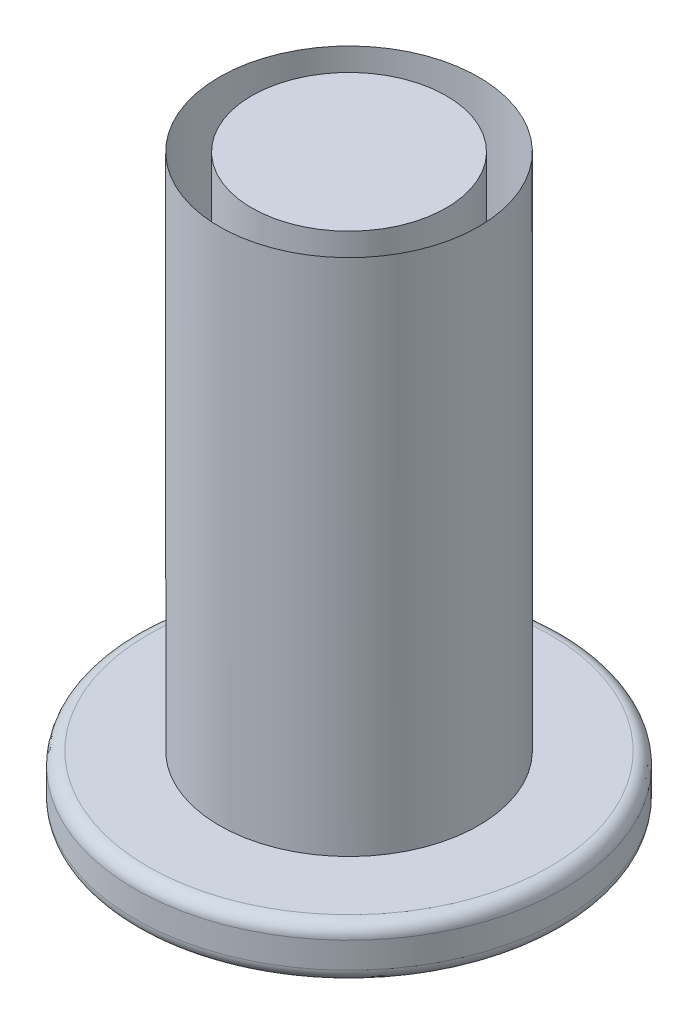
ISO-10303-21;
HEADER;
FILE_DESCRIPTION(('STEP AP214'),'2;1');
FILE_NAME('part.step','',(''),(''),'','','');
FILE_SCHEMA(('AUTOMOTIVE_DESIGN { 1 0 10303 214 1 1 1 1 }'));
ENDSEC;
DATA;
#1=APPLICATION_CONTEXT('core data for automotive mechanical design processes');
#2=APPLICATION_PROTOCOL_DEFINITION('international standard','automotive_design',2000,#1);
#3=PRODUCT_CONTEXT('',#1,'mechanical');
#4=PRODUCT('Part','Part','',(#3));
#5=PRODUCT_RELATED_PRODUCT_CATEGORY('part','',(#4));
#6=PRODUCT_DEFINITION_FORMATION('','',#4);
#7=PRODUCT_DEFINITION_CONTEXT('part definition',#1,'design');
#8=PRODUCT_DEFINITION('design','',#6,#7);
#9=PRODUCT_DEFINITION_SHAPE('','',#8);
#10=(LENGTH_UNIT() NAMED_UNIT(*) SI_UNIT(.MILLI.,.METRE.));
#11=(NAMED_UNIT(*) PLANE_ANGLE_UNIT() SI_UNIT($,.RADIAN.));
#12=(NAMED_UNIT(*) SI_UNIT($,.STERADIAN.) SOLID_ANGLE_UNIT());
#13=UNCERTAINTY_MEASURE_WITH_UNIT(LENGTH_MEASURE(1.E-05),#10,'distance_accuracy_value','');
#14=(GEOMETRIC_REPRESENTATION_CONTEXT(3) GLOBAL_UNCERTAINTY_ASSIGNED_CONTEXT((#13)) GLOBAL_UNIT_ASSIGNED_CONTEXT((#10,
#11,#12)) REPRESENTATION_CONTEXT('',''));
#15=CARTESIAN_POINT('',(0.,0.,0.));
#16=DIRECTION('',(0.,0.,1.));
#17=DIRECTION('',(1.,0.,0.));
#18=AXIS2_PLACEMENT_3D('',#15,#16,#17);
#19=CARTESIAN_POINT('',(0.,0.4,0.));
#20=DIRECTION('',(0.,1.,0.));
#21=DIRECTION('',(-1.,0.,0.));
#22=AXIS2_PLACEMENT_3D('',#19,#20,#21);
#23=CYLINDRICAL_SURFACE('',#22,1.);
#24=CARTESIAN_POINT('',(0.,4.4,0.));
#25=DIRECTION('',(0.,-1.,0.));
#26=DIRECTION('',(1.,0.,0.));
#27=AXIS2_PLACEMENT_3D('',#24,#25,#26);
#28=CIRCLE('',#27,1.);
#29=CARTESIAN_POINT('',(1.,4.4,0.));
#30=VERTEX_POINT('',#29);
#31=EDGE_CURVE('E43',#30,#30,#28,.F.);
#32=ORIENTED_EDGE('',*,*,#31,.F.);
#33=EDGE_LOOP('',(#32));
#34=FACE_BOUND('',#33,.T.);
#35=CARTESIAN_POINT('',(0.,0.4,0.));
#36=DIRECTION('',(0.,1.,0.));
#37=DIRECTION('',(-1.,0.,0.));
#38=AXIS2_PLACEMENT_3D('',#35,#36,#37);
#39=CIRCLE('',#38,1.);
#40=CARTESIAN_POINT('',(-1.,0.4,0.));
#41=VERTEX_POINT('',#40);
#42=EDGE_CURVE('E11',#41,#41,#39,.T.);
#43=ORIENTED_EDGE('',*,*,#42,.T.);
#44=EDGE_LOOP('',(#43));
#45=FACE_BOUND('',#44,.T.);
#46=ADVANCED_FACE('F42',(#34,#45),#23,.T.);
#47=OPEN_SHELL('',(#46));
#48=SHELL_BASED_SURFACE_MODEL('B2',(#47));
#49=CARTESIAN_POINT('',(0.,0.,0.));
#50=DIRECTION('',(0.,1.,0.));
#51=DIRECTION('',(-1.,0.,0.));
#52=AXIS2_PLACEMENT_3D('',#49,#50,#51);
#53=PLANE('',#52);
#54=CARTESIAN_POINT('',(0.,0.,0.));
#55=DIRECTION('',(0.,1.,0.));
#56=DIRECTION('',(-1.,0.,0.));
#57=AXIS2_PLACEMENT_3D('',#54,#55,#56);
#58=CIRCLE('',#57,1.55);
#59=CARTESIAN_POINT('',(-1.55,0.,0.));
#60=VERTEX_POINT('',#59);
#61=EDGE_CURVE('E41',#60,#60,#58,.F.);
#62=ORIENTED_EDGE('',*,*,#61,.T.);
#63=EDGE_LOOP('',(#62));
#64=FACE_BOUND('',#63,.T.);
#65=ADVANCED_FACE('F66',(#64),#53,.F.);
#66=CARTESIAN_POINT('',(0.,4.4,0.));
#67=DIRECTION('',(0.,1.,0.));
#68=DIRECTION('',(-1.,0.,0.));
#69=AXIS2_PLACEMENT_3D('',#66,#67,#68);
#70=CYLINDRICAL_SURFACE('',#69,1.65);
#71=CARTESIAN_POINT('',(0.,0.3,0.));
#72=DIRECTION('',(0.,-1.,0.));
#73=DIRECTION('',(1.,0.,0.));
#74=AXIS2_PLACEMENT_3D('',#71,#72,#73);
#75=CIRCLE('',#74,1.65);
#76=CARTESIAN_POINT('',(1.65,0.3,0.));
#77=VERTEX_POINT('',#76);
#78=EDGE_CURVE('E73',#77,#77,#75,.T.);
#79=ORIENTED_EDGE('',*,*,#78,.T.);
#80=EDGE_LOOP('',(#79));
#81=FACE_BOUND('',#80,.T.);
#82=CARTESIAN_POINT('',(0.,0.1,0.));
#83=DIRECTION('',(0.,1.,0.));
#84=DIRECTION('',(-1.,0.,0.));
#85=AXIS2_PLACEMENT_3D('',#82,#83,#84);
#86=CIRCLE('',#85,1.65);
#87=CARTESIAN_POINT('',(-1.65,0.1,0.));
#88=VERTEX_POINT('',#87);
#89=EDGE_CURVE('E77',#88,#88,#86,.T.);
#90=ORIENTED_EDGE('',*,*,#89,.T.);
#91=EDGE_LOOP('',(#90));
#92=FACE_BOUND('',#91,.T.);
#93=ADVANCED_FACE('F103',(#81,#92),#70,.T.);
#94=CARTESIAN_POINT('',(1.65,0.4,0.));
#95=DIRECTION('',(0.,-1.,0.));
#96=DIRECTION('',(1.,0.,0.));
#97=AXIS2_PLACEMENT_3D('',#94,#95,#96);
#98=PLANE('',#97);
#99=CARTESIAN_POINT('',(0.,0.4,0.));
#100=DIRECTION('',(0.,-1.,0.));
#101=DIRECTION('',(1.,0.,0.));
#102=AXIS2_PLACEMENT_3D('',#99,#100,#101);
#103=CIRCLE('',#102,1.55);
#104=CARTESIAN_POINT('',(1.55,0.4,0.));
#105=VERTEX_POINT('',#104);
#106=EDGE_CURVE('E81',#105,#105,#103,.F.);
#107=ORIENTED_EDGE('',*,*,#106,.T.);
#108=EDGE_LOOP('',(#107));
#109=FACE_BOUND('',#108,.T.);
#110=CARTESIAN_POINT('',(0.,0.4,0.));
#111=DIRECTION('',(0.,1.,0.));
#112=DIRECTION('',(-1.,0.,0.));
#113=AXIS2_PLACEMENT_3D('',#110,#111,#112);
#114=CIRCLE('',#113,0.750000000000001);
#115=CARTESIAN_POINT('',(-0.750000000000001,0.4,0.));
#116=VERTEX_POINT('',#115);
#117=EDGE_CURVE('E86',#116,#116,#114,.T.);
#118=ORIENTED_EDGE('',*,*,#117,.F.);
#119=EDGE_LOOP('',(#118));
#120=FACE_BOUND('',#119,.T.);
#121=ADVANCED_FACE('F98',(#109,#120),#98,.F.);
#122=CARTESIAN_POINT('',(0.,4.4,0.));
#123=DIRECTION('',(0.,1.,0.));
#124=DIRECTION('',(-1.,0.,0.));
#125=AXIS2_PLACEMENT_3D('',#122,#123,#124);
#126=CYLINDRICAL_SURFACE('',#125,0.750000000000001);
#127=CARTESIAN_POINT('',(0.,4.4,0.));
#128=DIRECTION('',(0.,1.,0.));
#129=DIRECTION('',(-1.,0.,0.));
#130=AXIS2_PLACEMENT_3D('',#127,#128,#129);
#131=CIRCLE('',#130,0.750000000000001);
#132=CARTESIAN_POINT('',(-0.75,4.4,0.));
#133=VERTEX_POINT('',#132);
#134=EDGE_CURVE('E89',#133,#133,#131,.T.);
#135=ORIENTED_EDGE('',*,*,#134,.F.);
#136=EDGE_LOOP('',(#135));
#137=FACE_BOUND('',#136,.T.);
#138=ORIENTED_EDGE('',*,*,#117,.T.);
#139=EDGE_LOOP('',(#138));
#140=FACE_BOUND('',#139,.T.);
#141=ADVANCED_FACE('F95',(#137,#140),#126,.T.);
#142=CARTESIAN_POINT('',(0.750000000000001,4.4,0.));
#143=DIRECTION('',(0.,-1.,0.));
#144=DIRECTION('',(1.,0.,0.));
#145=AXIS2_PLACEMENT_3D('',#142,#143,#144);
#146=PLANE('',#145);
#147=ORIENTED_EDGE('',*,*,#134,.T.);
#148=EDGE_LOOP('',(#147));
#149=FACE_BOUND('',#148,.T.);
#150=ADVANCED_FACE('F93',(#149),#146,.F.);
#151=CARTESIAN_POINT('',(0.,0.3,0.));
#152=DIRECTION('',(0.,-1.,0.));
#153=DIRECTION('',(1.,0.,0.));
#154=AXIS2_PLACEMENT_3D('',#151,#152,#153);
#155=TOROIDAL_SURFACE('',#154,1.55,0.1);
#156=ORIENTED_EDGE('',*,*,#78,.F.);
#157=EDGE_LOOP('',(#156));
#158=FACE_BOUND('',#157,.T.);
#159=ORIENTED_EDGE('',*,*,#106,.F.);
#160=EDGE_LOOP('',(#159));
#161=FACE_BOUND('',#160,.T.);
#162=ADVANCED_FACE('F114',(#158,#161),#155,.T.);
#163=CARTESIAN_POINT('',(0.,0.1,0.));
#164=DIRECTION('',(0.,1.,0.));
#165=DIRECTION('',(-1.,0.,0.));
#166=AXIS2_PLACEMENT_3D('',#163,#164,#165);
#167=TOROIDAL_SURFACE('',#166,1.55,0.1);
#168=ORIENTED_EDGE('',*,*,#61,.F.);
#169=EDGE_LOOP('',(#168));
#170=FACE_BOUND('',#169,.T.);
#171=ORIENTED_EDGE('',*,*,#89,.F.);
#172=EDGE_LOOP('',(#171));
#173=FACE_BOUND('',#172,.T.);
#174=ADVANCED_FACE('F68',(#170,#173),#167,.T.);
#175=CLOSED_SHELL('',(#65,#93,#121,#141,#150,#162,#174));
#176=MANIFOLD_SOLID_BREP('B6',#175);
#177=ADVANCED_BREP_SHAPE_REPRESENTATION('',(#18,#176),#14);
#178=MANIFOLD_SURFACE_SHAPE_REPRESENTATION('',(#18,#48),#14);
#179=SHAPE_REPRESENTATION('',(#18),#14);
#180=SHAPE_DEFINITION_REPRESENTATION(#9,#179);
#181=SHAPE_REPRESENTATION_RELATIONSHIP('','',#179,#177);
#182=SHAPE_REPRESENTATION_RELATIONSHIP('','',#179,#178);
ENDSEC;
END-ISO-10303-21;
